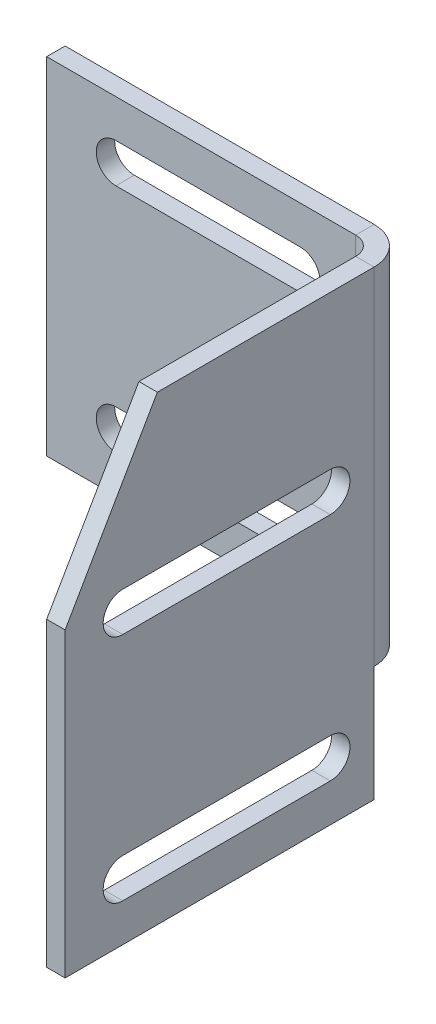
ISO-10303-21;
HEADER;
FILE_DESCRIPTION(('STEP AP214'),'2;1');
FILE_NAME('part.step','',(''),(''),'','','');
FILE_SCHEMA(('AUTOMOTIVE_DESIGN { 1 0 10303 214 1 1 1 1 }'));
ENDSEC;
DATA;
#1=APPLICATION_CONTEXT('core data for automotive mechanical design processes');
#2=APPLICATION_PROTOCOL_DEFINITION('international standard','automotive_design',2000,#1);
#3=PRODUCT_CONTEXT('',#1,'mechanical');
#4=PRODUCT('Part','Part','',(#3));
#5=PRODUCT_RELATED_PRODUCT_CATEGORY('part','',(#4));
#6=PRODUCT_DEFINITION_FORMATION('','',#4);
#7=PRODUCT_DEFINITION_CONTEXT('part definition',#1,'design');
#8=PRODUCT_DEFINITION('design','',#6,#7);
#9=PRODUCT_DEFINITION_SHAPE('','',#8);
#10=(LENGTH_UNIT() NAMED_UNIT(*) SI_UNIT(.MILLI.,.METRE.));
#11=(NAMED_UNIT(*) PLANE_ANGLE_UNIT() SI_UNIT($,.RADIAN.));
#12=(NAMED_UNIT(*) SI_UNIT($,.STERADIAN.) SOLID_ANGLE_UNIT());
#13=UNCERTAINTY_MEASURE_WITH_UNIT(LENGTH_MEASURE(1.E-05),#10,'distance_accuracy_value','');
#14=(GEOMETRIC_REPRESENTATION_CONTEXT(3) GLOBAL_UNCERTAINTY_ASSIGNED_CONTEXT((#13)) GLOBAL_UNIT_ASSIGNED_CONTEXT((#10,
#11,#12)) REPRESENTATION_CONTEXT('',''));
#15=CARTESIAN_POINT('',(0.,0.,0.));
#16=DIRECTION('',(0.,0.,1.));
#17=DIRECTION('',(1.,0.,0.));
#18=AXIS2_PLACEMENT_3D('',#15,#16,#17);
#19=CARTESIAN_POINT('',(75.,100.,8.00000000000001));
#20=DIRECTION('',(0.,1.,0.));
#21=DIRECTION('',(0.,0.,1.));
#22=AXIS2_PLACEMENT_3D('',#19,#20,#21);
#23=PLANE('',#22);
#24=DIRECTION('',(-1.,0.,0.));
#25=VECTOR('',#24,1.);
#26=CARTESIAN_POINT('',(75.,100.,8.00000000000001));
#27=LINE('',#26,#25);
#28=CARTESIAN_POINT('',(75.,100.,8.00000000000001));
#29=VERTEX_POINT('',#28);
#30=CARTESIAN_POINT('',(71.,100.,8.00000000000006));
#31=VERTEX_POINT('',#30);
#32=EDGE_CURVE('E277',#29,#31,#27,.T.);
#33=ORIENTED_EDGE('',*,*,#32,.F.);
#34=CARTESIAN_POINT('',(67.,100.,8.00000000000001));
#35=DIRECTION('',(0.,1.,0.));
#36=DIRECTION('',(0.,0.,1.));
#37=AXIS2_PLACEMENT_3D('',#34,#35,#36);
#38=CIRCLE('',#37,8.);
#39=CARTESIAN_POINT('',(67.,100.,0.));
#40=VERTEX_POINT('',#39);
#41=EDGE_CURVE('E323',#40,#29,#38,.F.);
#42=ORIENTED_EDGE('',*,*,#41,.F.);
#43=DIRECTION('',(0.,0.,-1.));
#44=VECTOR('',#43,1.);
#45=CARTESIAN_POINT('',(67.0000000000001,100.,4.));
#46=LINE('',#45,#44);
#47=CARTESIAN_POINT('',(67.0000000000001,100.,4.));
#48=VERTEX_POINT('',#47);
#49=EDGE_CURVE('E274',#48,#40,#46,.T.);
#50=ORIENTED_EDGE('',*,*,#49,.F.);
#51=CARTESIAN_POINT('',(67.,100.,8.00000000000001));
#52=DIRECTION('',(0.,1.,0.));
#53=DIRECTION('',(1.,0.,0.));
#54=AXIS2_PLACEMENT_3D('',#51,#52,#53);
#55=CIRCLE('',#54,4.);
#56=EDGE_CURVE('E465',#48,#31,#55,.F.);
#57=ORIENTED_EDGE('',*,*,#56,.T.);
#58=EDGE_LOOP('',(#33,#42,#50,#57));
#59=FACE_BOUND('',#58,.T.);
#60=ADVANCED_FACE('F46',(#59),#23,.T.);
#61=CARTESIAN_POINT('',(67.0000000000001,100.,4.));
#62=DIRECTION('',(0.,1.,0.));
#63=DIRECTION('',(0.,0.,1.));
#64=AXIS2_PLACEMENT_3D('',#61,#62,#63);
#65=PLANE('',#64);
#66=DIRECTION('',(0.,0.,1.));
#67=VECTOR('',#66,1.);
#68=CARTESIAN_POINT('',(71.,100.,0.));
#69=LINE('',#68,#67);
#70=CARTESIAN_POINT('',(71.,99.9999999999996,55.));
#71=VERTEX_POINT('',#70);
#72=EDGE_CURVE('E452',#31,#71,#69,.T.);
#73=ORIENTED_EDGE('',*,*,#72,.T.);
#74=DIRECTION('',(1.,0.,0.));
#75=VECTOR('',#74,1.);
#76=CARTESIAN_POINT('',(67.,99.9999999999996,55.));
#77=LINE('',#76,#75);
#78=CARTESIAN_POINT('',(75.,99.9999999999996,55.));
#79=VERTEX_POINT('',#78);
#80=EDGE_CURVE('E54',#71,#79,#77,.T.);
#81=ORIENTED_EDGE('',*,*,#80,.T.);
#82=DIRECTION('',(0.,0.,1.));
#83=VECTOR('',#82,1.);
#84=CARTESIAN_POINT('',(75.,100.,0.));
#85=LINE('',#84,#83);
#86=EDGE_CURVE('E327',#29,#79,#85,.T.);
#87=ORIENTED_EDGE('',*,*,#86,.F.);
#88=ORIENTED_EDGE('',*,*,#32,.T.);
#89=EDGE_LOOP('',(#73,#81,#87,#88));
#90=FACE_BOUND('',#89,.T.);
#91=ADVANCED_FACE('F578',(#90),#65,.T.);
#92=CARTESIAN_POINT('',(71.,100.,0.));
#93=DIRECTION('',(1.,0.,0.));
#94=DIRECTION('',(0.,0.,-1.));
#95=AXIS2_PLACEMENT_3D('',#92,#93,#94);
#96=PLANE('',#95);
#97=DIRECTION('',(0.,0.,-1.));
#98=VECTOR('',#97,1.);
#99=CARTESIAN_POINT('',(71.0000000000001,16.7499999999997,62.5000000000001));
#100=LINE('',#99,#98);
#101=CARTESIAN_POINT('',(71.0000000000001,16.7499999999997,62.5000000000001));
#102=VERTEX_POINT('',#101);
#103=CARTESIAN_POINT('',(71.,16.7499999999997,17.5));
#104=VERTEX_POINT('',#103);
#105=EDGE_CURVE('E494',#102,#104,#100,.T.);
#106=ORIENTED_EDGE('',*,*,#105,.F.);
#107=CARTESIAN_POINT('',(71.,12.4999999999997,62.5));
#108=DIRECTION('',(-1.,0.,0.));
#109=DIRECTION('',(0.,0.,-1.));
#110=AXIS2_PLACEMENT_3D('',#107,#108,#109);
#111=CIRCLE('',#110,4.25);
#112=CARTESIAN_POINT('',(71.,8.24999999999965,62.5));
#113=VERTEX_POINT('',#112);
#114=EDGE_CURVE('E346',#113,#102,#111,.T.);
#115=ORIENTED_EDGE('',*,*,#114,.F.);
#116=DIRECTION('',(0.,0.,1.));
#117=VECTOR('',#116,1.);
#118=CARTESIAN_POINT('',(71.,8.24999999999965,62.5));
#119=LINE('',#118,#117);
#120=CARTESIAN_POINT('',(71.,8.24999999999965,17.5));
#121=VERTEX_POINT('',#120);
#122=EDGE_CURVE('E310',#121,#113,#119,.T.);
#123=ORIENTED_EDGE('',*,*,#122,.F.);
#124=CARTESIAN_POINT('',(71.,12.4999999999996,17.5));
#125=DIRECTION('',(-1.,0.,0.));
#126=DIRECTION('',(0.,0.,1.));
#127=AXIS2_PLACEMENT_3D('',#124,#125,#126);
#128=CIRCLE('',#127,4.25);
#129=EDGE_CURVE('E502',#104,#121,#128,.T.);
#130=ORIENTED_EDGE('',*,*,#129,.F.);
#131=EDGE_LOOP('',(#106,#115,#123,#130));
#132=FACE_BOUND('',#131,.T.);
#133=DIRECTION('',(0.,0.,-1.));
#134=VECTOR('',#133,1.);
#135=CARTESIAN_POINT('',(71.0000000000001,66.7499999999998,62.5));
#136=LINE('',#135,#134);
#137=CARTESIAN_POINT('',(71.0000000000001,66.7499999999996,62.5));
#138=VERTEX_POINT('',#137);
#139=CARTESIAN_POINT('',(71.,66.7499999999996,17.5));
#140=VERTEX_POINT('',#139);
#141=EDGE_CURVE('E375',#138,#140,#136,.T.);
#142=ORIENTED_EDGE('',*,*,#141,.F.);
#143=CARTESIAN_POINT('',(71.0000000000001,62.4999999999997,62.5));
#144=DIRECTION('',(-1.,0.,0.));
#145=DIRECTION('',(0.,0.,-1.));
#146=AXIS2_PLACEMENT_3D('',#143,#144,#145);
#147=CIRCLE('',#146,4.25);
#148=CARTESIAN_POINT('',(71.0000000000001,58.2499999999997,62.5));
#149=VERTEX_POINT('',#148);
#150=EDGE_CURVE('E305',#149,#138,#147,.T.);
#151=ORIENTED_EDGE('',*,*,#150,.F.);
#152=DIRECTION('',(0.,0.,1.));
#153=VECTOR('',#152,1.);
#154=CARTESIAN_POINT('',(71.0000000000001,58.2499999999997,62.5));
#155=LINE('',#154,#153);
#156=CARTESIAN_POINT('',(71.,58.2499999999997,17.5000000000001));
#157=VERTEX_POINT('',#156);
#158=EDGE_CURVE('E383',#157,#149,#155,.T.);
#159=ORIENTED_EDGE('',*,*,#158,.F.);
#160=CARTESIAN_POINT('',(71.,62.4999999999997,17.5));
#161=DIRECTION('',(-1.,0.,0.));
#162=DIRECTION('',(0.,0.,1.));
#163=AXIS2_PLACEMENT_3D('',#160,#161,#162);
#164=CIRCLE('',#163,4.25);
#165=EDGE_CURVE('E379',#140,#157,#164,.T.);
#166=ORIENTED_EDGE('',*,*,#165,.F.);
#167=EDGE_LOOP('',(#142,#151,#159,#166));
#168=FACE_BOUND('',#167,.T.);
#169=DIRECTION('',(0.,-1.,0.));
#170=VECTOR('',#169,1.);
#171=CARTESIAN_POINT('',(71.,100.,75.0000000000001));
#172=LINE('',#171,#170);
#173=CARTESIAN_POINT('',(71.0000000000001,65.3589838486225,75.0000000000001));
#174=VERTEX_POINT('',#173);
#175=CARTESIAN_POINT('',(71.,0.,75.));
#176=VERTEX_POINT('',#175);
#177=EDGE_CURVE('E267',#174,#176,#172,.T.);
#178=ORIENTED_EDGE('',*,*,#177,.F.);
#179=DIRECTION('',(0.,-0.866025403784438,0.500000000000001));
#180=VECTOR('',#179,1.);
#181=CARTESIAN_POINT('',(71.0000000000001,65.3589838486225,75.0000000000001));
#182=LINE('',#181,#180);
#183=EDGE_CURVE('E68',#174,#71,#182,.F.);
#184=ORIENTED_EDGE('',*,*,#183,.T.);
#185=ORIENTED_EDGE('',*,*,#72,.F.);
#186=DIRECTION('',(0.,-1.,0.));
#187=VECTOR('',#186,1.);
#188=CARTESIAN_POINT('',(71.,100.,8.00000000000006));
#189=LINE('',#188,#187);
#190=CARTESIAN_POINT('',(71.,25.,8.00000000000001));
#191=VERTEX_POINT('',#190);
#192=EDGE_CURVE('E320',#31,#191,#189,.T.);
#193=ORIENTED_EDGE('',*,*,#192,.T.);
#194=DIRECTION('',(0.,-1.,0.));
#195=VECTOR('',#194,1.);
#196=CARTESIAN_POINT('',(71.,100.,8.00000000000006));
#197=LINE('',#196,#195);
#198=CARTESIAN_POINT('',(71.0000000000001,0.,8.00000000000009));
#199=VERTEX_POINT('',#198);
#200=EDGE_CURVE('E229',#199,#191,#197,.F.);
#201=ORIENTED_EDGE('',*,*,#200,.F.);
#202=DIRECTION('',(0.,0.,1.));
#203=VECTOR('',#202,1.);
#204=CARTESIAN_POINT('',(71.0000000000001,0.,0.));
#205=LINE('',#204,#203);
#206=EDGE_CURVE('E440',#199,#176,#205,.T.);
#207=ORIENTED_EDGE('',*,*,#206,.T.);
#208=EDGE_LOOP('',(#178,#184,#185,#193,#201,#207));
#209=FACE_BOUND('',#208,.T.);
#210=ADVANCED_FACE('F474',(#132,#168,#209),#96,.F.);
#211=CARTESIAN_POINT('',(75.,100.,75.0000000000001));
#212=DIRECTION('',(0.,0.,1.));
#213=DIRECTION('',(1.,0.,0.));
#214=AXIS2_PLACEMENT_3D('',#211,#212,#213);
#215=PLANE('',#214);
#216=DIRECTION('',(0.,-1.,0.));
#217=VECTOR('',#216,1.);
#218=CARTESIAN_POINT('',(75.,100.,75.0000000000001));
#219=LINE('',#218,#217);
#220=CARTESIAN_POINT('',(75.0000000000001,65.3589838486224,75.0000000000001));
#221=VERTEX_POINT('',#220);
#222=CARTESIAN_POINT('',(75.,0.,75.));
#223=VERTEX_POINT('',#222);
#224=EDGE_CURVE('E264',#221,#223,#219,.T.);
#225=ORIENTED_EDGE('',*,*,#224,.F.);
#226=DIRECTION('',(-1.,0.,0.));
#227=VECTOR('',#226,1.);
#228=CARTESIAN_POINT('',(75.0000000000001,65.3589838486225,75.));
#229=LINE('',#228,#227);
#230=EDGE_CURVE('E297',#221,#174,#229,.T.);
#231=ORIENTED_EDGE('',*,*,#230,.T.);
#232=ORIENTED_EDGE('',*,*,#177,.T.);
#233=DIRECTION('',(-1.,0.,0.));
#234=VECTOR('',#233,1.);
#235=CARTESIAN_POINT('',(75.,0.,75.));
#236=LINE('',#235,#234);
#237=EDGE_CURVE('E444',#223,#176,#236,.T.);
#238=ORIENTED_EDGE('',*,*,#237,.F.);
#239=EDGE_LOOP('',(#225,#231,#232,#238));
#240=FACE_BOUND('',#239,.T.);
#241=ADVANCED_FACE('F542',(#240),#215,.T.);
#242=CARTESIAN_POINT('',(75.,100.,0.));
#243=DIRECTION('',(1.,0.,0.));
#244=DIRECTION('',(0.,0.,-1.));
#245=AXIS2_PLACEMENT_3D('',#242,#243,#244);
#246=PLANE('',#245);
#247=CARTESIAN_POINT('',(75.,12.4999999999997,62.5));
#248=DIRECTION('',(1.,0.,0.));
#249=DIRECTION('',(0.,0.,-1.));
#250=AXIS2_PLACEMENT_3D('',#247,#248,#249);
#251=CIRCLE('',#250,4.25);
#252=CARTESIAN_POINT('',(75.0000000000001,16.7499999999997,62.5));
#253=VERTEX_POINT('',#252);
#254=CARTESIAN_POINT('',(75.,8.24999999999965,62.5));
#255=VERTEX_POINT('',#254);
#256=EDGE_CURVE('E309',#253,#255,#251,.T.);
#257=ORIENTED_EDGE('',*,*,#256,.F.);
#258=DIRECTION('',(0.,0.,1.));
#259=VECTOR('',#258,1.);
#260=CARTESIAN_POINT('',(75.,16.7499999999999,0.));
#261=LINE('',#260,#259);
#262=CARTESIAN_POINT('',(75.,16.7499999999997,17.5));
#263=VERTEX_POINT('',#262);
#264=EDGE_CURVE('E489',#263,#253,#261,.T.);
#265=ORIENTED_EDGE('',*,*,#264,.F.);
#266=CARTESIAN_POINT('',(75.,12.4999999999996,17.5));
#267=DIRECTION('',(1.,0.,0.));
#268=DIRECTION('',(0.,0.,-1.));
#269=AXIS2_PLACEMENT_3D('',#266,#267,#268);
#270=CIRCLE('',#269,4.25);
#271=CARTESIAN_POINT('',(75.,8.24999999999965,17.5));
#272=VERTEX_POINT('',#271);
#273=EDGE_CURVE('E331',#272,#263,#270,.T.);
#274=ORIENTED_EDGE('',*,*,#273,.F.);
#275=DIRECTION('',(0.,0.,-1.));
#276=VECTOR('',#275,1.);
#277=CARTESIAN_POINT('',(75.,8.24999999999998,0.));
#278=LINE('',#277,#276);
#279=EDGE_CURVE('E509',#255,#272,#278,.T.);
#280=ORIENTED_EDGE('',*,*,#279,.F.);
#281=EDGE_LOOP('',(#257,#265,#274,#280));
#282=FACE_BOUND('',#281,.T.);
#283=CARTESIAN_POINT('',(75.0000000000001,62.4999999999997,62.5));
#284=DIRECTION('',(1.,0.,0.));
#285=DIRECTION('',(0.,0.,-1.));
#286=AXIS2_PLACEMENT_3D('',#283,#284,#285);
#287=CIRCLE('',#286,4.25);
#288=CARTESIAN_POINT('',(75.,66.7499999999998,62.5));
#289=VERTEX_POINT('',#288);
#290=CARTESIAN_POINT('',(75.,58.2499999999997,62.5));
#291=VERTEX_POINT('',#290);
#292=EDGE_CURVE('E290',#289,#291,#287,.T.);
#293=ORIENTED_EDGE('',*,*,#292,.F.);
#294=DIRECTION('',(0.,0.,1.));
#295=VECTOR('',#294,1.);
#296=CARTESIAN_POINT('',(75.,66.75,0.));
#297=LINE('',#296,#295);
#298=CARTESIAN_POINT('',(75.,66.7499999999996,17.5));
#299=VERTEX_POINT('',#298);
#300=EDGE_CURVE('E280',#299,#289,#297,.T.);
#301=ORIENTED_EDGE('',*,*,#300,.F.);
#302=CARTESIAN_POINT('',(75.,62.4999999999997,17.5));
#303=DIRECTION('',(1.,0.,0.));
#304=DIRECTION('',(0.,0.,-1.));
#305=AXIS2_PLACEMENT_3D('',#302,#303,#304);
#306=CIRCLE('',#305,4.25);
#307=CARTESIAN_POINT('',(75.,58.2499999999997,17.5));
#308=VERTEX_POINT('',#307);
#309=EDGE_CURVE('E283',#308,#299,#306,.T.);
#310=ORIENTED_EDGE('',*,*,#309,.F.);
#311=DIRECTION('',(0.,0.,-1.));
#312=VECTOR('',#311,1.);
#313=CARTESIAN_POINT('',(75.0000000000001,58.2499999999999,0.));
#314=LINE('',#313,#312);
#315=EDGE_CURVE('E287',#291,#308,#314,.T.);
#316=ORIENTED_EDGE('',*,*,#315,.F.);
#317=EDGE_LOOP('',(#293,#301,#310,#316));
#318=FACE_BOUND('',#317,.T.);
#319=ORIENTED_EDGE('',*,*,#86,.T.);
#320=DIRECTION('',(0.,0.866025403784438,-0.500000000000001));
#321=VECTOR('',#320,1.);
#322=CARTESIAN_POINT('',(75.,123.815698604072,41.2499999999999));
#323=LINE('',#322,#321);
#324=EDGE_CURVE('E11',#79,#221,#323,.F.);
#325=ORIENTED_EDGE('',*,*,#324,.T.);
#326=ORIENTED_EDGE('',*,*,#224,.T.);
#327=DIRECTION('',(0.,0.,1.));
#328=VECTOR('',#327,1.);
#329=CARTESIAN_POINT('',(75.0000000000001,0.,0.));
#330=LINE('',#329,#328);
#331=CARTESIAN_POINT('',(75.0000000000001,0.,8.00000000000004));
#332=VERTEX_POINT('',#331);
#333=EDGE_CURVE('E448',#332,#223,#330,.T.);
#334=ORIENTED_EDGE('',*,*,#333,.F.);
#335=DIRECTION('',(0.,-1.,0.));
#336=VECTOR('',#335,1.);
#337=CARTESIAN_POINT('',(75.0000000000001,0.,8.00000000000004));
#338=LINE('',#337,#336);
#339=CARTESIAN_POINT('',(75.,25.,8.00000000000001));
#340=VERTEX_POINT('',#339);
#341=EDGE_CURVE('E230',#340,#332,#338,.T.);
#342=ORIENTED_EDGE('',*,*,#341,.F.);
#343=DIRECTION('',(0.,-1.,0.));
#344=VECTOR('',#343,1.);
#345=CARTESIAN_POINT('',(75.,100.,8.00000000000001));
#346=LINE('',#345,#344);
#347=EDGE_CURVE('E254',#29,#340,#346,.T.);
#348=ORIENTED_EDGE('',*,*,#347,.F.);
#349=EDGE_LOOP('',(#319,#325,#326,#334,#342,#348));
#350=FACE_BOUND('',#349,.T.);
#351=ADVANCED_FACE('F538',(#282,#318,#350),#246,.T.);
#352=CARTESIAN_POINT('',(67.,100.,8.00000000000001));
#353=DIRECTION('',(0.,-1.,0.));
#354=DIRECTION('',(0.,0.,-1.));
#355=AXIS2_PLACEMENT_3D('',#352,#353,#354);
#356=CYLINDRICAL_SURFACE('',#355,8.);
#357=CARTESIAN_POINT('',(67.,25.,7.99999999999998));
#358=DIRECTION('',(0.,1.,0.));
#359=DIRECTION('',(-1.,0.,0.));
#360=AXIS2_PLACEMENT_3D('',#357,#358,#359);
#361=CIRCLE('',#360,8.);
#362=CARTESIAN_POINT('',(67.,24.9999999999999,0.));
#363=VERTEX_POINT('',#362);
#364=EDGE_CURVE('E486',#363,#340,#361,.F.);
#365=ORIENTED_EDGE('',*,*,#364,.F.);
#366=DIRECTION('',(0.,-1.,0.));
#367=VECTOR('',#366,1.);
#368=CARTESIAN_POINT('',(67.,100.,0.));
#369=LINE('',#368,#367);
#370=EDGE_CURVE('E240',#40,#363,#369,.T.);
#371=ORIENTED_EDGE('',*,*,#370,.F.);
#372=ORIENTED_EDGE('',*,*,#41,.T.);
#373=ORIENTED_EDGE('',*,*,#347,.T.);
#374=EDGE_LOOP('',(#365,#371,#372,#373));
#375=FACE_BOUND('',#374,.T.);
#376=ADVANCED_FACE('F541',(#375),#356,.T.);
#377=CARTESIAN_POINT('',(0.,100.,0.));
#378=DIRECTION('',(0.,0.,-1.));
#379=DIRECTION('',(-1.,0.,0.));
#380=AXIS2_PLACEMENT_3D('',#377,#378,#379);
#381=PLANE('',#380);
#382=DIRECTION('',(1.,0.,0.));
#383=VECTOR('',#382,1.);
#384=CARTESIAN_POINT('',(0.,25.,0.));
#385=LINE('',#384,#383);
#386=CARTESIAN_POINT('',(0.,25.,0.));
#387=VERTEX_POINT('',#386);
#388=EDGE_CURVE('E221',#387,#363,#385,.T.);
#389=ORIENTED_EDGE('',*,*,#388,.F.);
#390=DIRECTION('',(0.,-1.,0.));
#391=VECTOR('',#390,1.);
#392=CARTESIAN_POINT('',(0.,100.,0.));
#393=LINE('',#392,#391);
#394=CARTESIAN_POINT('',(0.,100.,0.));
#395=VERTEX_POINT('',#394);
#396=EDGE_CURVE('E237',#395,#387,#393,.T.);
#397=ORIENTED_EDGE('',*,*,#396,.F.);
#398=DIRECTION('',(1.,0.,0.));
#399=VECTOR('',#398,1.);
#400=CARTESIAN_POINT('',(0.,100.,0.));
#401=LINE('',#400,#399);
#402=EDGE_CURVE('E326',#395,#40,#401,.T.);
#403=ORIENTED_EDGE('',*,*,#402,.T.);
#404=ORIENTED_EDGE('',*,*,#370,.T.);
#405=EDGE_LOOP('',(#389,#397,#403,#404));
#406=FACE_BOUND('',#405,.T.);
#407=CARTESIAN_POINT('',(15.0000000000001,37.5,0.));
#408=DIRECTION('',(0.,0.,-1.));
#409=DIRECTION('',(-1.,0.,0.));
#410=AXIS2_PLACEMENT_3D('',#407,#408,#409);
#411=CIRCLE('',#410,4.25);
#412=CARTESIAN_POINT('',(15.,33.25,0.));
#413=VERTEX_POINT('',#412);
#414=CARTESIAN_POINT('',(15.,41.75,0.));
#415=VERTEX_POINT('',#414);
#416=EDGE_CURVE('E371',#413,#415,#411,.T.);
#417=ORIENTED_EDGE('',*,*,#416,.F.);
#418=DIRECTION('',(-1.,0.,0.));
#419=VECTOR('',#418,1.);
#420=CARTESIAN_POINT('',(0.,33.25,0.));
#421=LINE('',#420,#419);
#422=CARTESIAN_POINT('',(55.,33.25,0.));
#423=VERTEX_POINT('',#422);
#424=EDGE_CURVE('E356',#423,#413,#421,.T.);
#425=ORIENTED_EDGE('',*,*,#424,.F.);
#426=CARTESIAN_POINT('',(55.,37.5,0.));
#427=DIRECTION('',(0.,0.,-1.));
#428=DIRECTION('',(-1.,0.,0.));
#429=AXIS2_PLACEMENT_3D('',#426,#427,#428);
#430=CIRCLE('',#429,4.25);
#431=CARTESIAN_POINT('',(55.0000000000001,41.75,0.));
#432=VERTEX_POINT('',#431);
#433=EDGE_CURVE('E364',#432,#423,#430,.T.);
#434=ORIENTED_EDGE('',*,*,#433,.F.);
#435=DIRECTION('',(1.,0.,0.));
#436=VECTOR('',#435,1.);
#437=CARTESIAN_POINT('',(0.,41.75,0.));
#438=LINE('',#437,#436);
#439=EDGE_CURVE('E368',#415,#432,#438,.T.);
#440=ORIENTED_EDGE('',*,*,#439,.F.);
#441=EDGE_LOOP('',(#417,#425,#434,#440));
#442=FACE_BOUND('',#441,.T.);
#443=CARTESIAN_POINT('',(15.,87.5,0.));
#444=DIRECTION('',(0.,0.,-1.));
#445=DIRECTION('',(-1.,0.,0.));
#446=AXIS2_PLACEMENT_3D('',#443,#444,#445);
#447=CIRCLE('',#446,4.25);
#448=CARTESIAN_POINT('',(15.,83.25,0.));
#449=VERTEX_POINT('',#448);
#450=CARTESIAN_POINT('',(15.,91.75,0.));
#451=VERTEX_POINT('',#450);
#452=EDGE_CURVE('E437',#449,#451,#447,.T.);
#453=ORIENTED_EDGE('',*,*,#452,.F.);
#454=DIRECTION('',(-1.,0.,0.));
#455=VECTOR('',#454,1.);
#456=CARTESIAN_POINT('',(0.,83.25,0.));
#457=LINE('',#456,#455);
#458=CARTESIAN_POINT('',(55.,83.2499999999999,0.));
#459=VERTEX_POINT('',#458);
#460=EDGE_CURVE('E418',#459,#449,#457,.T.);
#461=ORIENTED_EDGE('',*,*,#460,.F.);
#462=CARTESIAN_POINT('',(55.,87.5,0.));
#463=DIRECTION('',(0.,0.,-1.));
#464=DIRECTION('',(-1.,0.,0.));
#465=AXIS2_PLACEMENT_3D('',#462,#463,#464);
#466=CIRCLE('',#465,4.25);
#467=CARTESIAN_POINT('',(55.,91.75,0.));
#468=VERTEX_POINT('',#467);
#469=EDGE_CURVE('E430',#468,#459,#466,.T.);
#470=ORIENTED_EDGE('',*,*,#469,.F.);
#471=DIRECTION('',(1.,0.,0.));
#472=VECTOR('',#471,1.);
#473=CARTESIAN_POINT('',(0.,91.75,0.));
#474=LINE('',#473,#472);
#475=EDGE_CURVE('E434',#451,#468,#474,.T.);
#476=ORIENTED_EDGE('',*,*,#475,.F.);
#477=EDGE_LOOP('',(#453,#461,#470,#476));
#478=FACE_BOUND('',#477,.T.);
#479=ADVANCED_FACE('F234',(#406,#442,#478),#381,.T.);
#480=CARTESIAN_POINT('',(0.,100.,4.00000000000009));
#481=DIRECTION('',(-1.,0.,0.));
#482=DIRECTION('',(0.,0.,1.));
#483=AXIS2_PLACEMENT_3D('',#480,#481,#482);
#484=PLANE('',#483);
#485=DIRECTION('',(0.,0.,-1.));
#486=VECTOR('',#485,1.);
#487=CARTESIAN_POINT('',(0.,25.,8.00000000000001));
#488=LINE('',#487,#486);
#489=CARTESIAN_POINT('',(0.,25.,4.));
#490=VERTEX_POINT('',#489);
#491=EDGE_CURVE('E218',#490,#387,#488,.T.);
#492=ORIENTED_EDGE('',*,*,#491,.F.);
#493=DIRECTION('',(0.,-1.,0.));
#494=VECTOR('',#493,1.);
#495=CARTESIAN_POINT('',(0.,100.,4.00000000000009));
#496=LINE('',#495,#494);
#497=CARTESIAN_POINT('',(0.,100.,4.00000000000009));
#498=VERTEX_POINT('',#497);
#499=EDGE_CURVE('E249',#498,#490,#496,.T.);
#500=ORIENTED_EDGE('',*,*,#499,.F.);
#501=DIRECTION('',(0.,0.,-1.));
#502=VECTOR('',#501,1.);
#503=CARTESIAN_POINT('',(0.,100.,4.00000000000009));
#504=LINE('',#503,#502);
#505=EDGE_CURVE('E247',#498,#395,#504,.T.);
#506=ORIENTED_EDGE('',*,*,#505,.T.);
#507=ORIENTED_EDGE('',*,*,#396,.T.);
#508=EDGE_LOOP('',(#492,#500,#506,#507));
#509=FACE_BOUND('',#508,.T.);
#510=ADVANCED_FACE('F245',(#509),#484,.T.);
#511=CARTESIAN_POINT('',(0.,100.,4.00000000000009));
#512=DIRECTION('',(0.,0.,-1.));
#513=DIRECTION('',(-1.,0.,0.));
#514=AXIS2_PLACEMENT_3D('',#511,#512,#513);
#515=PLANE('',#514);
#516=DIRECTION('',(1.,0.,0.));
#517=VECTOR('',#516,1.);
#518=CARTESIAN_POINT('',(15.0000000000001,33.25,4.));
#519=LINE('',#518,#517);
#520=CARTESIAN_POINT('',(15.0000000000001,33.25,4.));
#521=VERTEX_POINT('',#520);
#522=CARTESIAN_POINT('',(55.,33.25,4.));
#523=VERTEX_POINT('',#522);
#524=EDGE_CURVE('E334',#521,#523,#519,.T.);
#525=ORIENTED_EDGE('',*,*,#524,.F.);
#526=CARTESIAN_POINT('',(15.0000000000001,37.5,3.99999999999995));
#527=DIRECTION('',(0.,0.,1.));
#528=DIRECTION('',(-1.,0.,0.));
#529=AXIS2_PLACEMENT_3D('',#526,#527,#528);
#530=CIRCLE('',#529,4.25);
#531=CARTESIAN_POINT('',(15.,41.7500000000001,4.));
#532=VERTEX_POINT('',#531);
#533=EDGE_CURVE('E337',#532,#521,#530,.T.);
#534=ORIENTED_EDGE('',*,*,#533,.F.);
#535=DIRECTION('',(-1.,0.,0.));
#536=VECTOR('',#535,1.);
#537=CARTESIAN_POINT('',(15.,41.7500000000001,4.));
#538=LINE('',#537,#536);
#539=CARTESIAN_POINT('',(55.,41.7500000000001,4.));
#540=VERTEX_POINT('',#539);
#541=EDGE_CURVE('E316',#540,#532,#538,.T.);
#542=ORIENTED_EDGE('',*,*,#541,.F.);
#543=CARTESIAN_POINT('',(55.,37.5,3.99999999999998));
#544=DIRECTION('',(0.,0.,1.));
#545=DIRECTION('',(1.,0.,0.));
#546=AXIS2_PLACEMENT_3D('',#543,#544,#545);
#547=CIRCLE('',#546,4.25);
#548=EDGE_CURVE('E336',#523,#540,#547,.T.);
#549=ORIENTED_EDGE('',*,*,#548,.F.);
#550=EDGE_LOOP('',(#525,#534,#542,#549));
#551=FACE_BOUND('',#550,.T.);
#552=DIRECTION('',(1.,0.,0.));
#553=VECTOR('',#552,1.);
#554=CARTESIAN_POINT('',(15.0000000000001,83.25,4.));
#555=LINE('',#554,#553);
#556=CARTESIAN_POINT('',(15.0000000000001,83.25,4.));
#557=VERTEX_POINT('',#556);
#558=CARTESIAN_POINT('',(55.,83.25,4.));
#559=VERTEX_POINT('',#558);
#560=EDGE_CURVE('E403',#557,#559,#555,.T.);
#561=ORIENTED_EDGE('',*,*,#560,.F.);
#562=CARTESIAN_POINT('',(15.0000000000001,87.5,4.));
#563=DIRECTION('',(0.,0.,1.));
#564=DIRECTION('',(-1.,0.,0.));
#565=AXIS2_PLACEMENT_3D('',#562,#563,#564);
#566=CIRCLE('',#565,4.25);
#567=CARTESIAN_POINT('',(15.0000000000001,91.75,4.));
#568=VERTEX_POINT('',#567);
#569=EDGE_CURVE('E391',#568,#557,#566,.T.);
#570=ORIENTED_EDGE('',*,*,#569,.F.);
#571=DIRECTION('',(-1.,0.,0.));
#572=VECTOR('',#571,1.);
#573=CARTESIAN_POINT('',(15.0000000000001,91.75,4.));
#574=LINE('',#573,#572);
#575=CARTESIAN_POINT('',(55.,91.75,4.));
#576=VERTEX_POINT('',#575);
#577=EDGE_CURVE('E410',#576,#568,#574,.T.);
#578=ORIENTED_EDGE('',*,*,#577,.F.);
#579=CARTESIAN_POINT('',(55.,87.5,4.00000000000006));
#580=DIRECTION('',(0.,0.,1.));
#581=DIRECTION('',(1.,0.,0.));
#582=AXIS2_PLACEMENT_3D('',#579,#580,#581);
#583=CIRCLE('',#582,4.25);
#584=EDGE_CURVE('E406',#559,#576,#583,.T.);
#585=ORIENTED_EDGE('',*,*,#584,.F.);
#586=EDGE_LOOP('',(#561,#570,#578,#585));
#587=FACE_BOUND('',#586,.T.);
#588=ORIENTED_EDGE('',*,*,#499,.T.);
#589=DIRECTION('',(1.,0.,0.));
#590=VECTOR('',#589,1.);
#591=CARTESIAN_POINT('',(0.,25.,4.));
#592=LINE('',#591,#590);
#593=CARTESIAN_POINT('',(67.0000000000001,24.9999999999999,4.));
#594=VERTEX_POINT('',#593);
#595=EDGE_CURVE('E224',#490,#594,#592,.T.);
#596=ORIENTED_EDGE('',*,*,#595,.T.);
#597=DIRECTION('',(0.,-1.,0.));
#598=VECTOR('',#597,1.);
#599=CARTESIAN_POINT('',(67.0000000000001,100.,4.));
#600=LINE('',#599,#598);
#601=EDGE_CURVE('E257',#48,#594,#600,.T.);
#602=ORIENTED_EDGE('',*,*,#601,.F.);
#603=DIRECTION('',(1.,0.,0.));
#604=VECTOR('',#603,1.);
#605=CARTESIAN_POINT('',(0.,100.,4.00000000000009));
#606=LINE('',#605,#604);
#607=EDGE_CURVE('E461',#498,#48,#606,.T.);
#608=ORIENTED_EDGE('',*,*,#607,.F.);
#609=EDGE_LOOP('',(#588,#596,#602,#608));
#610=FACE_BOUND('',#609,.T.);
#611=ADVANCED_FACE('F483',(#551,#587,#610),#515,.F.);
#612=CARTESIAN_POINT('',(67.,100.,8.00000000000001));
#613=DIRECTION('',(0.,-1.,0.));
#614=DIRECTION('',(0.,0.,-1.));
#615=AXIS2_PLACEMENT_3D('',#612,#613,#614);
#616=CYLINDRICAL_SURFACE('',#615,4.);
#617=ORIENTED_EDGE('',*,*,#601,.T.);
#618=CARTESIAN_POINT('',(67.,25.,7.99999999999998));
#619=DIRECTION('',(0.,1.,0.));
#620=DIRECTION('',(-1.,0.,0.));
#621=AXIS2_PLACEMENT_3D('',#618,#619,#620);
#622=CIRCLE('',#621,4.);
#623=EDGE_CURVE('E293',#594,#191,#622,.F.);
#624=ORIENTED_EDGE('',*,*,#623,.T.);
#625=ORIENTED_EDGE('',*,*,#192,.F.);
#626=ORIENTED_EDGE('',*,*,#56,.F.);
#627=EDGE_LOOP('',(#617,#624,#625,#626));
#628=FACE_BOUND('',#627,.T.);
#629=ADVANCED_FACE('F478',(#628),#616,.F.);
#630=CARTESIAN_POINT('',(67.,100.,8.00000000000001));
#631=DIRECTION('',(0.,1.,0.));
#632=DIRECTION('',(0.,0.,1.));
#633=AXIS2_PLACEMENT_3D('',#630,#631,#632);
#634=PLANE('',#633);
#635=ORIENTED_EDGE('',*,*,#607,.T.);
#636=ORIENTED_EDGE('',*,*,#49,.T.);
#637=ORIENTED_EDGE('',*,*,#402,.F.);
#638=ORIENTED_EDGE('',*,*,#505,.F.);
#639=EDGE_LOOP('',(#635,#636,#637,#638));
#640=FACE_BOUND('',#639,.T.);
#641=ADVANCED_FACE('F567',(#640),#634,.T.);
#642=CARTESIAN_POINT('',(67.0000000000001,0.,8.00000000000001));
#643=DIRECTION('',(0.,1.,0.));
#644=DIRECTION('',(0.,0.,1.));
#645=AXIS2_PLACEMENT_3D('',#642,#643,#644);
#646=PLANE('',#645);
#647=ORIENTED_EDGE('',*,*,#206,.F.);
#648=DIRECTION('',(1.,0.,0.));
#649=VECTOR('',#648,1.);
#650=CARTESIAN_POINT('',(71.0000000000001,0.,8.00000000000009));
#651=LINE('',#650,#649);
#652=EDGE_CURVE('E270',#199,#332,#651,.T.);
#653=ORIENTED_EDGE('',*,*,#652,.T.);
#654=ORIENTED_EDGE('',*,*,#333,.T.);
#655=ORIENTED_EDGE('',*,*,#237,.T.);
#656=EDGE_LOOP('',(#647,#653,#654,#655));
#657=FACE_BOUND('',#656,.T.);
#658=ADVANCED_FACE('F558',(#657),#646,.F.);
#659=CARTESIAN_POINT('',(15.,87.5,-1.));
#660=DIRECTION('',(0.,0.,1.));
#661=DIRECTION('',(1.,0.,0.));
#662=AXIS2_PLACEMENT_3D('',#659,#660,#661);
#663=CYLINDRICAL_SURFACE('',#662,4.25);
#664=ORIENTED_EDGE('',*,*,#452,.T.);
#665=DIRECTION('',(0.,0.,1.));
#666=VECTOR('',#665,1.);
#667=CARTESIAN_POINT('',(15.,91.75,-1.));
#668=LINE('',#667,#666);
#669=EDGE_CURVE('E415',#451,#568,#668,.T.);
#670=ORIENTED_EDGE('',*,*,#669,.T.);
#671=ORIENTED_EDGE('',*,*,#569,.T.);
#672=DIRECTION('',(0.,0.,1.));
#673=VECTOR('',#672,1.);
#674=CARTESIAN_POINT('',(15.,83.25,-1.));
#675=LINE('',#674,#673);
#676=EDGE_CURVE('E414',#449,#557,#675,.T.);
#677=ORIENTED_EDGE('',*,*,#676,.F.);
#678=EDGE_LOOP('',(#664,#670,#671,#677));
#679=FACE_BOUND('',#678,.T.);
#680=ADVANCED_FACE('F574',(#679),#663,.F.);
#681=CARTESIAN_POINT('',(15.,91.75,-1.));
#682=DIRECTION('',(0.,1.,0.));
#683=DIRECTION('',(0.,0.,1.));
#684=AXIS2_PLACEMENT_3D('',#681,#682,#683);
#685=PLANE('',#684);
#686=ORIENTED_EDGE('',*,*,#475,.T.);
#687=DIRECTION('',(0.,0.,1.));
#688=VECTOR('',#687,1.);
#689=CARTESIAN_POINT('',(55.,91.75,-1.));
#690=LINE('',#689,#688);
#691=EDGE_CURVE('E419',#468,#576,#690,.T.);
#692=ORIENTED_EDGE('',*,*,#691,.T.);
#693=ORIENTED_EDGE('',*,*,#577,.T.);
#694=ORIENTED_EDGE('',*,*,#669,.F.);
#695=EDGE_LOOP('',(#686,#692,#693,#694));
#696=FACE_BOUND('',#695,.T.);
#697=ADVANCED_FACE('F617',(#696),#685,.F.);
#698=CARTESIAN_POINT('',(55.,87.5,-0.999999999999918));
#699=DIRECTION('',(0.,0.,1.));
#700=DIRECTION('',(1.,0.,0.));
#701=AXIS2_PLACEMENT_3D('',#698,#699,#700);
#702=CYLINDRICAL_SURFACE('',#701,4.25);
#703=ORIENTED_EDGE('',*,*,#469,.T.);
#704=DIRECTION('',(0.,0.,1.));
#705=VECTOR('',#704,1.);
#706=CARTESIAN_POINT('',(55.,83.2499999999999,-1.));
#707=LINE('',#706,#705);
#708=EDGE_CURVE('E422',#459,#559,#707,.T.);
#709=ORIENTED_EDGE('',*,*,#708,.T.);
#710=ORIENTED_EDGE('',*,*,#584,.T.);
#711=ORIENTED_EDGE('',*,*,#691,.F.);
#712=EDGE_LOOP('',(#703,#709,#710,#711));
#713=FACE_BOUND('',#712,.T.);
#714=ADVANCED_FACE('F619',(#713),#702,.F.);
#715=CARTESIAN_POINT('',(15.,83.25,-1.));
#716=DIRECTION('',(0.,-1.,0.));
#717=DIRECTION('',(0.,0.,-1.));
#718=AXIS2_PLACEMENT_3D('',#715,#716,#717);
#719=PLANE('',#718);
#720=ORIENTED_EDGE('',*,*,#460,.T.);
#721=ORIENTED_EDGE('',*,*,#676,.T.);
#722=ORIENTED_EDGE('',*,*,#560,.T.);
#723=ORIENTED_EDGE('',*,*,#708,.F.);
#724=EDGE_LOOP('',(#720,#721,#722,#723));
#725=FACE_BOUND('',#724,.T.);
#726=ADVANCED_FACE('F606',(#725),#719,.F.);
#727=CARTESIAN_POINT('',(76.0000000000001,62.4999999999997,62.5));
#728=DIRECTION('',(-1.,0.,0.));
#729=DIRECTION('',(0.,0.,1.));
#730=AXIS2_PLACEMENT_3D('',#727,#728,#729);
#731=CYLINDRICAL_SURFACE('',#730,4.25);
#732=ORIENTED_EDGE('',*,*,#292,.T.);
#733=DIRECTION('',(-1.,0.,0.));
#734=VECTOR('',#733,1.);
#735=CARTESIAN_POINT('',(76.0000000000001,58.2499999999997,62.5));
#736=LINE('',#735,#734);
#737=EDGE_CURVE('E388',#291,#149,#736,.T.);
#738=ORIENTED_EDGE('',*,*,#737,.T.);
#739=ORIENTED_EDGE('',*,*,#150,.T.);
#740=DIRECTION('',(-1.,0.,0.));
#741=VECTOR('',#740,1.);
#742=CARTESIAN_POINT('',(76.0000000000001,66.7499999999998,62.5));
#743=LINE('',#742,#741);
#744=EDGE_CURVE('E387',#289,#138,#743,.T.);
#745=ORIENTED_EDGE('',*,*,#744,.F.);
#746=EDGE_LOOP('',(#732,#738,#739,#745));
#747=FACE_BOUND('',#746,.T.);
#748=ADVANCED_FACE('F626',(#747),#731,.F.);
#749=CARTESIAN_POINT('',(76.0000000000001,58.2499999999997,62.5));
#750=DIRECTION('',(0.,-1.,0.));
#751=DIRECTION('',(0.,0.,-1.));
#752=AXIS2_PLACEMENT_3D('',#749,#750,#751);
#753=PLANE('',#752);
#754=ORIENTED_EDGE('',*,*,#315,.T.);
#755=DIRECTION('',(-1.,0.,0.));
#756=VECTOR('',#755,1.);
#757=CARTESIAN_POINT('',(76.,58.2499999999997,17.5000000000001));
#758=LINE('',#757,#756);
#759=EDGE_CURVE('E392',#308,#157,#758,.T.);
#760=ORIENTED_EDGE('',*,*,#759,.T.);
#761=ORIENTED_EDGE('',*,*,#158,.T.);
#762=ORIENTED_EDGE('',*,*,#737,.F.);
#763=EDGE_LOOP('',(#754,#760,#761,#762));
#764=FACE_BOUND('',#763,.T.);
#765=ADVANCED_FACE('F656',(#764),#753,.F.);
#766=CARTESIAN_POINT('',(76.,62.4999999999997,17.5));
#767=DIRECTION('',(-1.,0.,0.));
#768=DIRECTION('',(0.,0.,1.));
#769=AXIS2_PLACEMENT_3D('',#766,#767,#768);
#770=CYLINDRICAL_SURFACE('',#769,4.25);
#771=ORIENTED_EDGE('',*,*,#309,.T.);
#772=DIRECTION('',(-1.,0.,0.));
#773=VECTOR('',#772,1.);
#774=CARTESIAN_POINT('',(76.,66.7499999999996,17.5));
#775=LINE('',#774,#773);
#776=EDGE_CURVE('E395',#299,#140,#775,.T.);
#777=ORIENTED_EDGE('',*,*,#776,.T.);
#778=ORIENTED_EDGE('',*,*,#165,.T.);
#779=ORIENTED_EDGE('',*,*,#759,.F.);
#780=EDGE_LOOP('',(#771,#777,#778,#779));
#781=FACE_BOUND('',#780,.T.);
#782=ADVANCED_FACE('F664',(#781),#770,.F.);
#783=CARTESIAN_POINT('',(76.0000000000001,66.7499999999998,62.5));
#784=DIRECTION('',(0.,1.,0.));
#785=DIRECTION('',(0.,0.,1.));
#786=AXIS2_PLACEMENT_3D('',#783,#784,#785);
#787=PLANE('',#786);
#788=ORIENTED_EDGE('',*,*,#300,.T.);
#789=ORIENTED_EDGE('',*,*,#744,.T.);
#790=ORIENTED_EDGE('',*,*,#141,.T.);
#791=ORIENTED_EDGE('',*,*,#776,.F.);
#792=EDGE_LOOP('',(#788,#789,#790,#791));
#793=FACE_BOUND('',#792,.T.);
#794=ADVANCED_FACE('F673',(#793),#787,.F.);
#795=CARTESIAN_POINT('',(15.0000000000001,37.5,-1.00000000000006));
#796=DIRECTION('',(0.,0.,1.));
#797=DIRECTION('',(1.,0.,0.));
#798=AXIS2_PLACEMENT_3D('',#795,#796,#797);
#799=CYLINDRICAL_SURFACE('',#798,4.25);
#800=ORIENTED_EDGE('',*,*,#416,.T.);
#801=DIRECTION('',(0.,0.,1.));
#802=VECTOR('',#801,1.);
#803=CARTESIAN_POINT('',(15.,41.75,-1.));
#804=LINE('',#803,#802);
#805=EDGE_CURVE('E353',#415,#532,#804,.T.);
#806=ORIENTED_EDGE('',*,*,#805,.T.);
#807=ORIENTED_EDGE('',*,*,#533,.T.);
#808=DIRECTION('',(0.,0.,1.));
#809=VECTOR('',#808,1.);
#810=CARTESIAN_POINT('',(15.0000000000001,33.25,-1.));
#811=LINE('',#810,#809);
#812=EDGE_CURVE('E312',#413,#521,#811,.T.);
#813=ORIENTED_EDGE('',*,*,#812,.F.);
#814=EDGE_LOOP('',(#800,#806,#807,#813));
#815=FACE_BOUND('',#814,.T.);
#816=ADVANCED_FACE('F682',(#815),#799,.F.);
#817=CARTESIAN_POINT('',(15.,41.75,-1.));
#818=DIRECTION('',(0.,1.,0.));
#819=DIRECTION('',(0.,0.,1.));
#820=AXIS2_PLACEMENT_3D('',#817,#818,#819);
#821=PLANE('',#820);
#822=ORIENTED_EDGE('',*,*,#439,.T.);
#823=DIRECTION('',(0.,0.,1.));
#824=VECTOR('',#823,1.);
#825=CARTESIAN_POINT('',(55.0000000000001,41.75,-1.));
#826=LINE('',#825,#824);
#827=EDGE_CURVE('E357',#432,#540,#826,.T.);
#828=ORIENTED_EDGE('',*,*,#827,.T.);
#829=ORIENTED_EDGE('',*,*,#541,.T.);
#830=ORIENTED_EDGE('',*,*,#805,.F.);
#831=EDGE_LOOP('',(#822,#828,#829,#830));
#832=FACE_BOUND('',#831,.T.);
#833=ADVANCED_FACE('F691',(#832),#821,.F.);
#834=CARTESIAN_POINT('',(55.0000000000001,37.5,-1.));
#835=DIRECTION('',(0.,0.,1.));
#836=DIRECTION('',(1.,0.,0.));
#837=AXIS2_PLACEMENT_3D('',#834,#835,#836);
#838=CYLINDRICAL_SURFACE('',#837,4.25);
#839=ORIENTED_EDGE('',*,*,#433,.T.);
#840=DIRECTION('',(0.,0.,1.));
#841=VECTOR('',#840,1.);
#842=CARTESIAN_POINT('',(55.0000000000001,33.25,-1.));
#843=LINE('',#842,#841);
#844=EDGE_CURVE('E315',#423,#523,#843,.T.);
#845=ORIENTED_EDGE('',*,*,#844,.T.);
#846=ORIENTED_EDGE('',*,*,#548,.T.);
#847=ORIENTED_EDGE('',*,*,#827,.F.);
#848=EDGE_LOOP('',(#839,#845,#846,#847));
#849=FACE_BOUND('',#848,.T.);
#850=ADVANCED_FACE('F700',(#849),#838,.F.);
#851=CARTESIAN_POINT('',(15.0000000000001,33.25,-1.));
#852=DIRECTION('',(0.,-1.,0.));
#853=DIRECTION('',(0.,0.,-1.));
#854=AXIS2_PLACEMENT_3D('',#851,#852,#853);
#855=PLANE('',#854);
#856=ORIENTED_EDGE('',*,*,#424,.T.);
#857=ORIENTED_EDGE('',*,*,#812,.T.);
#858=ORIENTED_EDGE('',*,*,#524,.T.);
#859=ORIENTED_EDGE('',*,*,#844,.F.);
#860=EDGE_LOOP('',(#856,#857,#858,#859));
#861=FACE_BOUND('',#860,.T.);
#862=ADVANCED_FACE('F709',(#861),#855,.F.);
#863=CARTESIAN_POINT('',(76.,12.4999999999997,62.5));
#864=DIRECTION('',(-1.,0.,0.));
#865=DIRECTION('',(0.,0.,1.));
#866=AXIS2_PLACEMENT_3D('',#863,#864,#865);
#867=CYLINDRICAL_SURFACE('',#866,4.25);
#868=ORIENTED_EDGE('',*,*,#256,.T.);
#869=DIRECTION('',(-1.,0.,0.));
#870=VECTOR('',#869,1.);
#871=CARTESIAN_POINT('',(76.,8.24999999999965,62.5));
#872=LINE('',#871,#870);
#873=EDGE_CURVE('E306',#255,#113,#872,.T.);
#874=ORIENTED_EDGE('',*,*,#873,.T.);
#875=ORIENTED_EDGE('',*,*,#114,.T.);
#876=DIRECTION('',(-1.,0.,0.));
#877=VECTOR('',#876,1.);
#878=CARTESIAN_POINT('',(76.0000000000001,16.7499999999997,62.5));
#879=LINE('',#878,#877);
#880=EDGE_CURVE('E332',#253,#102,#879,.T.);
#881=ORIENTED_EDGE('',*,*,#880,.F.);
#882=EDGE_LOOP('',(#868,#874,#875,#881));
#883=FACE_BOUND('',#882,.T.);
#884=ADVANCED_FACE('F520',(#883),#867,.F.);
#885=CARTESIAN_POINT('',(76.,8.24999999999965,62.5));
#886=DIRECTION('',(0.,-1.,0.));
#887=DIRECTION('',(0.,0.,-1.));
#888=AXIS2_PLACEMENT_3D('',#885,#886,#887);
#889=PLANE('',#888);
#890=ORIENTED_EDGE('',*,*,#279,.T.);
#891=DIRECTION('',(-1.,0.,0.));
#892=VECTOR('',#891,1.);
#893=CARTESIAN_POINT('',(76.,8.24999999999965,17.5));
#894=LINE('',#893,#892);
#895=EDGE_CURVE('E505',#272,#121,#894,.T.);
#896=ORIENTED_EDGE('',*,*,#895,.T.);
#897=ORIENTED_EDGE('',*,*,#122,.T.);
#898=ORIENTED_EDGE('',*,*,#873,.F.);
#899=EDGE_LOOP('',(#890,#896,#897,#898));
#900=FACE_BOUND('',#899,.T.);
#901=ADVANCED_FACE('F534',(#900),#889,.F.);
#902=CARTESIAN_POINT('',(76.,12.4999999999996,17.5));
#903=DIRECTION('',(-1.,0.,0.));
#904=DIRECTION('',(0.,0.,1.));
#905=AXIS2_PLACEMENT_3D('',#902,#903,#904);
#906=CYLINDRICAL_SURFACE('',#905,4.25);
#907=ORIENTED_EDGE('',*,*,#273,.T.);
#908=DIRECTION('',(-1.,0.,0.));
#909=VECTOR('',#908,1.);
#910=CARTESIAN_POINT('',(76.,16.7499999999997,17.5));
#911=LINE('',#910,#909);
#912=EDGE_CURVE('E329',#263,#104,#911,.T.);
#913=ORIENTED_EDGE('',*,*,#912,.T.);
#914=ORIENTED_EDGE('',*,*,#129,.T.);
#915=ORIENTED_EDGE('',*,*,#895,.F.);
#916=EDGE_LOOP('',(#907,#913,#914,#915));
#917=FACE_BOUND('',#916,.T.);
#918=ADVANCED_FACE('F532',(#917),#906,.F.);
#919=CARTESIAN_POINT('',(76.0000000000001,16.7499999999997,62.5));
#920=DIRECTION('',(0.,1.,0.));
#921=DIRECTION('',(0.,0.,1.));
#922=AXIS2_PLACEMENT_3D('',#919,#920,#921);
#923=PLANE('',#922);
#924=ORIENTED_EDGE('',*,*,#264,.T.);
#925=ORIENTED_EDGE('',*,*,#880,.T.);
#926=ORIENTED_EDGE('',*,*,#105,.T.);
#927=ORIENTED_EDGE('',*,*,#912,.F.);
#928=EDGE_LOOP('',(#924,#925,#926,#927));
#929=FACE_BOUND('',#928,.T.);
#930=ADVANCED_FACE('F526',(#929),#923,.F.);
#931=CARTESIAN_POINT('',(0.,25.,8.00000000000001));
#932=DIRECTION('',(0.,1.,0.));
#933=DIRECTION('',(-1.,0.,0.));
#934=AXIS2_PLACEMENT_3D('',#931,#932,#933);
#935=PLANE('',#934);
#936=ORIENTED_EDGE('',*,*,#364,.T.);
#937=DIRECTION('',(1.,0.,0.));
#938=VECTOR('',#937,1.);
#939=CARTESIAN_POINT('',(0.,25.,8.00000000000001));
#940=LINE('',#939,#938);
#941=EDGE_CURVE('E242',#191,#340,#940,.T.);
#942=ORIENTED_EDGE('',*,*,#941,.F.);
#943=ORIENTED_EDGE('',*,*,#623,.F.);
#944=ORIENTED_EDGE('',*,*,#595,.F.);
#945=ORIENTED_EDGE('',*,*,#491,.T.);
#946=ORIENTED_EDGE('',*,*,#388,.T.);
#947=EDGE_LOOP('',(#936,#942,#943,#944,#945,#946));
#948=FACE_BOUND('',#947,.T.);
#949=ADVANCED_FACE('F220',(#948),#935,.F.);
#950=CARTESIAN_POINT('',(0.,0.,8.00000000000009));
#951=DIRECTION('',(0.,0.,-1.));
#952=DIRECTION('',(-1.,0.,0.));
#953=AXIS2_PLACEMENT_3D('',#950,#951,#952);
#954=PLANE('',#953);
#955=ORIENTED_EDGE('',*,*,#200,.T.);
#956=ORIENTED_EDGE('',*,*,#941,.T.);
#957=ORIENTED_EDGE('',*,*,#341,.T.);
#958=ORIENTED_EDGE('',*,*,#652,.F.);
#959=EDGE_LOOP('',(#955,#956,#957,#958));
#960=FACE_BOUND('',#959,.T.);
#961=ADVANCED_FACE('F753',(#960),#954,.T.);
#962=CARTESIAN_POINT('',(75.0000000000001,65.3589838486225,75.));
#963=DIRECTION('',(0.,-0.500000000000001,-0.866025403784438));
#964=DIRECTION('',(0.,0.866025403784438,-0.500000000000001));
#965=AXIS2_PLACEMENT_3D('',#962,#963,#964);
#966=PLANE('',#965);
#967=ORIENTED_EDGE('',*,*,#324,.F.);
#968=ORIENTED_EDGE('',*,*,#80,.F.);
#969=ORIENTED_EDGE('',*,*,#183,.F.);
#970=ORIENTED_EDGE('',*,*,#230,.F.);
#971=EDGE_LOOP('',(#967,#968,#969,#970));
#972=FACE_BOUND('',#971,.T.);
#973=ADVANCED_FACE('F554',(#972),#966,.F.);
#974=CLOSED_SHELL('',(#60,#91,#210,#241,#351,#376,#479,#510,#611,#629,#641,#658,#680,#697,#714,
#726,#748,#765,#782,#794,#816,#833,#850,#862,#884,#901,#918,#930,#949,#961,#973));
#975=MANIFOLD_SOLID_BREP('B2',#974);
#976=ADVANCED_BREP_SHAPE_REPRESENTATION('',(#18,#975),#14);
#977=SHAPE_DEFINITION_REPRESENTATION(#9,#976);
ENDSEC;
END-ISO-10303-21;
